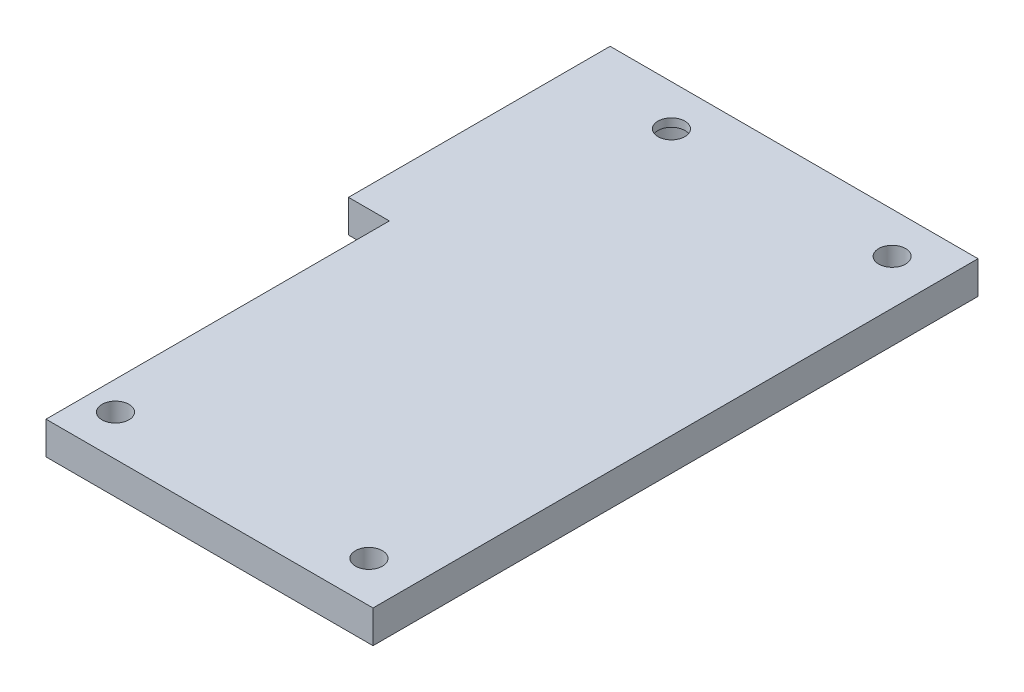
from build123d import *

# Parameters (mm, degrees)
SKETCH1_W           = 45
SKETCH1_H           = 74
SKETCH1_R           = 1.65
BOSS_EXTRUDE1_DEPTH = 4
SKETCH3_R           = 3.75
CUT_EXTRUDE2_DEPTH  = 3
SKETCH4_W           = 5
SKETCH4_H           = 42
CUT_EXTRUDE3_DEPTH  = 44.488504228


with BuildPart() as part:
    # Sketch1 → Boss-Extrude1 (new body)
    with BuildSketch(Plane(origin=(0, 0, 0), x_dir=(1, 0, 0), z_dir=(0, 1, 0))):
        Rectangle(SKETCH1_W, SKETCH1_H)
        with Locations(Location((-10, 32, 0), (0, 0, 270))):
            Circle(SKETCH1_R, mode=Mode.SUBTRACT)
        with Locations(Location((17, 32, 0), (0, 0, 270))):
            Circle(SKETCH1_R, mode=Mode.SUBTRACT)
        with Locations(Location((-14, -32, 0), (0, 0, 270))):
            Circle(SKETCH1_R, mode=Mode.SUBTRACT)
        with Locations(Location((17, -32, 0), (0, 0, 270))):
            Circle(SKETCH1_R, mode=Mode.SUBTRACT)
    extrude(amount=BOSS_EXTRUDE1_DEPTH)

    # Sketch3 → Cut-Extrude2 (cut)
    with BuildSketch(Plane.XZ):
        with Locations(Location((-10, -32, 0), (0, 0, 270))):
            Circle(SKETCH3_R)
    extrude(amount=-CUT_EXTRUDE2_DEPTH, mode=Mode.SUBTRACT)

    # Sketch4 → Cut-Extrude3 (cut, through all)
    with BuildSketch(Plane.XZ):
        with Locations((-20, 16)):
            Rectangle(SKETCH4_W, SKETCH4_H)
    extrude(amount=-CUT_EXTRUDE3_DEPTH, mode=Mode.SUBTRACT)


solid = part.part
